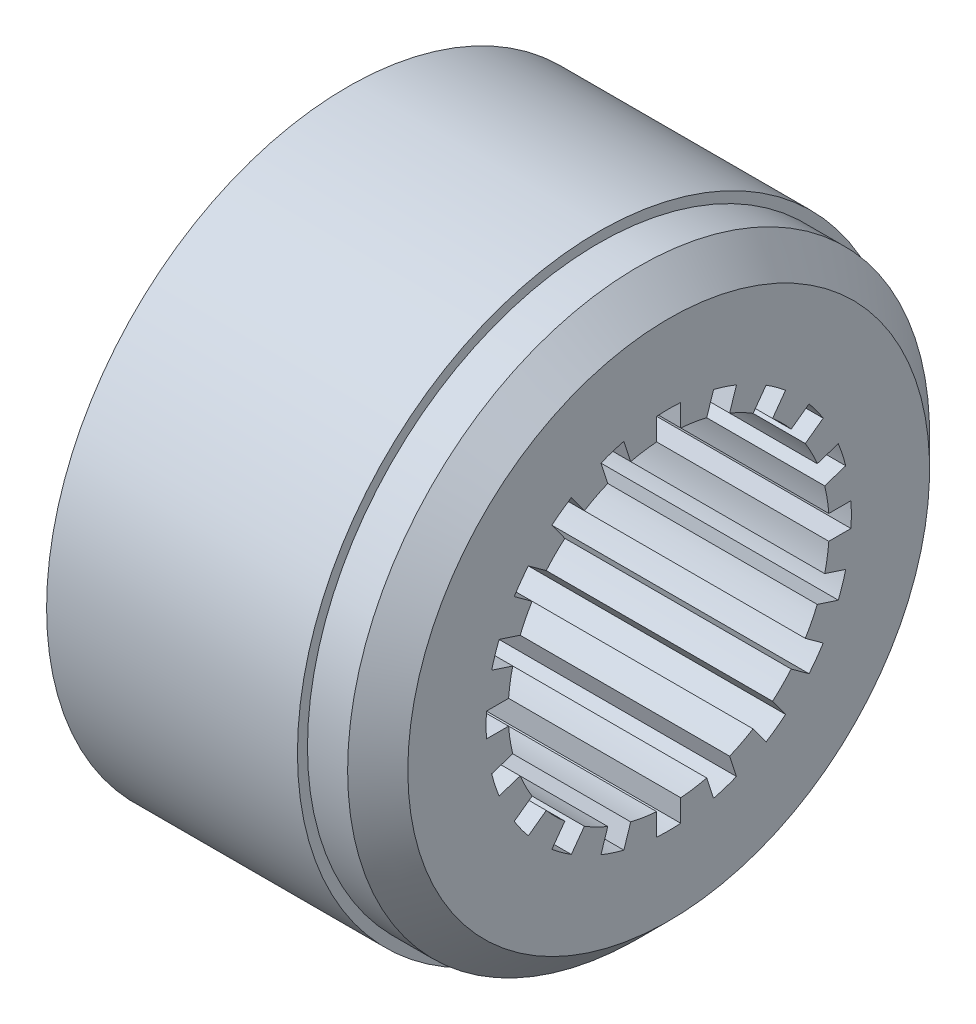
from build123d import *

# Parameters (mm, degrees)
ENL_V_MAT_EXTRU_1_DEPTH      = 133.853302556
R_P_TITION_CIRCULAIRE1_COUNT = 3


with BuildPart() as part:
    # Esquisse1 → R_volution1 (revolve)
    with BuildSketch(Plane.XY, mode=Mode.PRIVATE) as r_volution1_sk:
        Polygon((3.5, 40), (83.5, 40), (83.5, 65), (76, 72.5), (66, 72.5), (66, 75), (3.5, 75), align=None)
    revolve(r_volution1_sk.sketch.rotate(Axis((0, 0, 0), (1, 0, 0)), 90), axis=Axis((0, 0, 0), (1, 0, 0)))

    # Esquisse3 → Diam_tre du per_age _16.5 _16.5_1 (revolve, cut)
    with BuildSketch(Plane(origin=(3.5, 62.5, 0), x_dir=(0, 0, 1), z_dir=(0, 1, 0))):
        Polygon((0, 0), (0, 18.957100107), (8.25, 14), (8.25, 0), align=None)
    diam_tre_du_per_age_16_5_16_5_1 = revolve(axis=Axis((-2.85, 62.5, 0), (1, 0, 0)), mode=Mode.SUBTRACT)

    # Esquisse5 → Enl_v. mat.-Extru.1 (cut, through all)
    with BuildSketch(Plane.ZY.offset(-3.5)):
        with BuildLine():
            Line((11.176508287, 44.10595949), (8.334035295, 35.357727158))
            Line((8.334035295, 35.357727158), (14.040374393, 33.503625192))
            Line((14.040374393, 33.503625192), (16.882847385, 42.251857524))
            ThreePointArc((16.882847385, 42.251857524), (14.060273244, 43.273071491), (11.176508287, 44.10595949))
        make_face()
        with BuildLine():
            Line((-3, 45.400991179), (-3, 36.202555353))
            Line((-3, 36.202555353), (3, 36.202555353))
            Line((3, 36.202555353), (3, 45.400991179))
            ThreePointArc((3, 45.400991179), (0, 45.5), (-3, 45.400991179))
        make_face()
        with BuildLine():
            Line((24.258982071, 38.493529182), (18.852277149, 31.051838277))
            Line((18.852277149, 31.051838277), (23.706379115, 27.525126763))
            Line((23.706379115, 27.525126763), (29.113084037, 34.966817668))
            ThreePointArc((29.113084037, 34.966817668), (26.744228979, 36.810273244), (24.258982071, 38.493529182))
        make_face()
        with BuildLine():
            Line((34.966817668, 29.113084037), (27.525126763, 23.706379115))
            Line((27.525126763, 23.706379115), (31.051838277, 18.852277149))
            Line((31.051838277, 18.852277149), (38.493529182, 24.258982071))
            ThreePointArc((38.493529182, 24.258982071), (36.810273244, 26.744228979), (34.966817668, 29.113084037))
        make_face()
        with BuildLine():
            Line((42.251857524, 16.882847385), (33.503625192, 14.040374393))
            Line((33.503625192, 14.040374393), (35.357727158, 8.334035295))
            Line((35.357727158, 8.334035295), (44.10595949, 11.176508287))
            ThreePointArc((44.10595949, 11.176508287), (43.273071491, 14.060273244), (42.251857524, 16.882847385))
        make_face()
        with BuildLine():
            Line((45.400991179, 3), (36.202555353, 3))
            Line((36.202555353, 3), (36.202555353, -3))
            Line((36.202555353, -3), (45.400991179, -3))
            ThreePointArc((45.400991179, -3), (45.5, 0), (45.400991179, 3))
        make_face()
        with BuildLine():
            Line((44.10595949, -11.176508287), (35.357727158, -8.334035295))
            Line((35.357727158, -8.334035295), (33.503625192, -14.040374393))
            Line((33.503625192, -14.040374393), (42.251857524, -16.882847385))
            ThreePointArc((42.251857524, -16.882847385), (43.273071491, -14.060273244), (44.10595949, -11.176508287))
        make_face()
        with BuildLine():
            Line((38.493529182, -24.258982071), (31.051838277, -18.852277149))
            Line((31.051838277, -18.852277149), (27.525126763, -23.706379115))
            Line((27.525126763, -23.706379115), (34.966817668, -29.113084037))
            ThreePointArc((34.966817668, -29.113084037), (36.810273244, -26.744228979), (38.493529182, -24.258982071))
        make_face()
        with BuildLine():
            Line((29.113084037, -34.966817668), (23.706379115, -27.525126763))
            Line((23.706379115, -27.525126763), (18.852277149, -31.051838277))
            Line((18.852277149, -31.051838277), (24.258982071, -38.493529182))
            ThreePointArc((24.258982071, -38.493529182), (26.744228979, -36.810273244), (29.113084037, -34.966817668))
        make_face()
        with BuildLine():
            Line((16.882847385, -42.251857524), (14.040374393, -33.503625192))
            Line((14.040374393, -33.503625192), (8.334035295, -35.357727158))
            Line((8.334035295, -35.357727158), (11.176508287, -44.10595949))
            ThreePointArc((11.176508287, -44.10595949), (14.060273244, -43.273071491), (16.882847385, -42.251857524))
        make_face()
        with BuildLine():
            Line((3, -45.400991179), (3, -36.202555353))
            Line((3, -36.202555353), (-3, -36.202555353))
            Line((-3, -36.202555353), (-3, -45.400991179))
            ThreePointArc((-3, -45.400991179), (0, -45.5), (3, -45.400991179))
        make_face()
        with BuildLine():
            Line((-11.176508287, -44.10595949), (-8.334035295, -35.357727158))
            Line((-8.334035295, -35.357727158), (-14.040374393, -33.503625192))
            Line((-14.040374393, -33.503625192), (-16.882847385, -42.251857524))
            ThreePointArc((-16.882847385, -42.251857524), (-14.060273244, -43.273071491), (-11.176508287, -44.10595949))
        make_face()
        with BuildLine():
            Line((-24.258982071, -38.493529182), (-18.852277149, -31.051838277))
            Line((-18.852277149, -31.051838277), (-23.706379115, -27.525126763))
            Line((-23.706379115, -27.525126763), (-29.113084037, -34.966817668))
            ThreePointArc((-29.113084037, -34.966817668), (-26.744228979, -36.810273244), (-24.258982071, -38.493529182))
        make_face()
        with BuildLine():
            Line((-34.966817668, -29.113084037), (-27.525126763, -23.706379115))
            Line((-27.525126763, -23.706379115), (-31.051838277, -18.852277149))
            Line((-31.051838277, -18.852277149), (-38.493529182, -24.258982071))
            ThreePointArc((-38.493529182, -24.258982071), (-36.810273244, -26.744228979), (-34.966817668, -29.113084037))
        make_face()
        with BuildLine():
            Line((-42.251857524, -16.882847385), (-33.503625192, -14.040374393))
            Line((-33.503625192, -14.040374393), (-35.357727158, -8.334035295))
            Line((-35.357727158, -8.334035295), (-44.10595949, -11.176508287))
            ThreePointArc((-44.10595949, -11.176508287), (-43.273071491, -14.060273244), (-42.251857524, -16.882847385))
        make_face()
        with BuildLine():
            Line((-45.400991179, -3), (-36.202555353, -3))
            Line((-36.202555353, -3), (-36.202555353, 3))
            Line((-36.202555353, 3), (-45.400991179, 3))
            ThreePointArc((-45.400991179, 3), (-45.5, 0), (-45.400991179, -3))
        make_face()
        with BuildLine():
            Line((-44.10595949, 11.176508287), (-35.357727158, 8.334035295))
            Line((-35.357727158, 8.334035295), (-33.503625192, 14.040374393))
            Line((-33.503625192, 14.040374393), (-42.251857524, 16.882847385))
            ThreePointArc((-42.251857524, 16.882847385), (-43.273071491, 14.060273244), (-44.10595949, 11.176508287))
        make_face()
        with BuildLine():
            Line((-38.493529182, 24.258982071), (-31.051838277, 18.852277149))
            Line((-31.051838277, 18.852277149), (-27.525126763, 23.706379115))
            Line((-27.525126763, 23.706379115), (-34.966817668, 29.113084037))
            ThreePointArc((-34.966817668, 29.113084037), (-36.810273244, 26.744228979), (-38.493529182, 24.258982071))
        make_face()
        with BuildLine():
            Line((-29.113084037, 34.966817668), (-23.706379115, 27.525126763))
            Line((-23.706379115, 27.525126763), (-18.852277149, 31.051838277))
            Line((-18.852277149, 31.051838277), (-24.258982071, 38.493529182))
            ThreePointArc((-24.258982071, 38.493529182), (-26.744228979, 36.810273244), (-29.113084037, 34.966817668))
        make_face()
        with BuildLine():
            Line((-16.882847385, 42.251857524), (-14.040374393, 33.503625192))
            Line((-14.040374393, 33.503625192), (-8.334035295, 35.357727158))
            Line((-8.334035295, 35.357727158), (-11.176508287, 44.10595949))
            ThreePointArc((-11.176508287, 44.10595949), (-14.060273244, 43.273071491), (-16.882847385, 42.251857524))
        make_face()
    extrude(amount=-ENL_V_MAT_EXTRU_1_DEPTH, mode=Mode.SUBTRACT)

    # R_p_tition circulaire1: Diam_tre du per_age _16.5 _16.5_1 ×3 about axis
    r_p_tition_circulaire1_axis = Axis((0, 0, 0), (1, 0, 0))
    for i in range(1, R_P_TITION_CIRCULAIRE1_COUNT):
        add(diam_tre_du_per_age_16_5_16_5_1.rotate(r_p_tition_circulaire1_axis, i * 360 / R_P_TITION_CIRCULAIRE1_COUNT), mode=Mode.SUBTRACT)


solid = part.part
